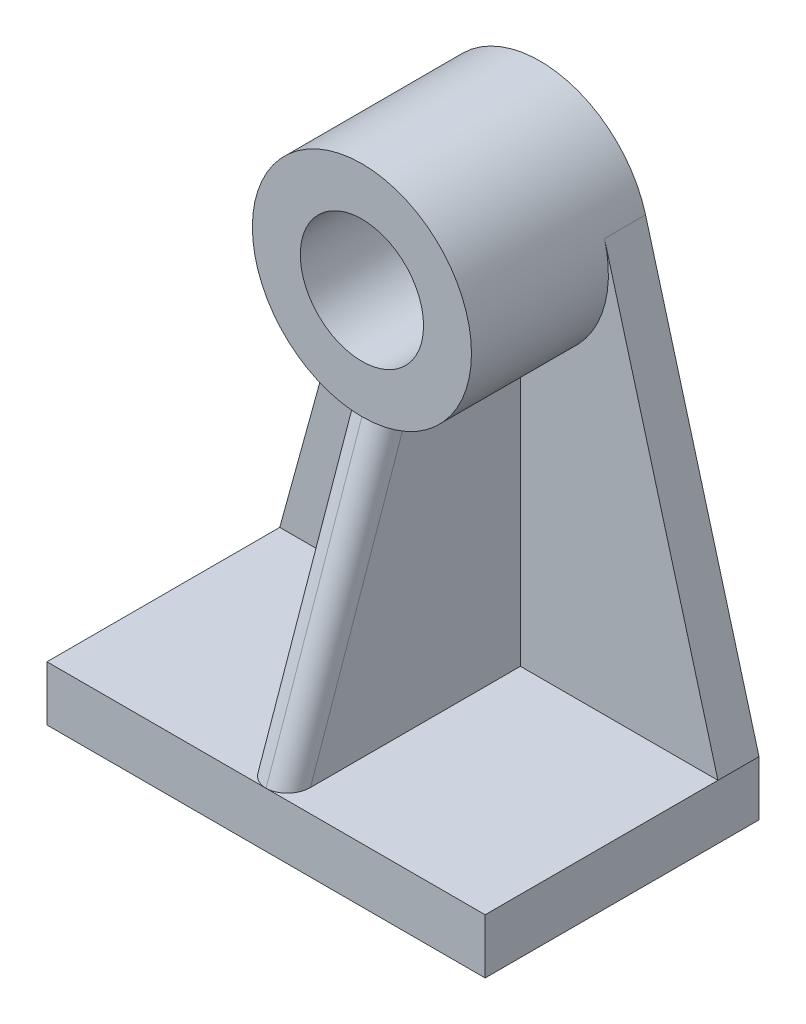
ISO-10303-21;
HEADER;
FILE_DESCRIPTION(('STEP AP214'),'2;1');
FILE_NAME('part.step','',(''),(''),'','','');
FILE_SCHEMA(('AUTOMOTIVE_DESIGN { 1 0 10303 214 1 1 1 1 }'));
ENDSEC;
DATA;
#1=APPLICATION_CONTEXT('core data for automotive mechanical design processes');
#2=APPLICATION_PROTOCOL_DEFINITION('international standard','automotive_design',2000,#1);
#3=PRODUCT_CONTEXT('',#1,'mechanical');
#4=PRODUCT('Part','Part','',(#3));
#5=PRODUCT_RELATED_PRODUCT_CATEGORY('part','',(#4));
#6=PRODUCT_DEFINITION_FORMATION('','',#4);
#7=PRODUCT_DEFINITION_CONTEXT('part definition',#1,'design');
#8=PRODUCT_DEFINITION('design','',#6,#7);
#9=PRODUCT_DEFINITION_SHAPE('','',#8);
#10=(LENGTH_UNIT() NAMED_UNIT(*) SI_UNIT(.MILLI.,.METRE.));
#11=(NAMED_UNIT(*) PLANE_ANGLE_UNIT() SI_UNIT($,.RADIAN.));
#12=(NAMED_UNIT(*) SI_UNIT($,.STERADIAN.) SOLID_ANGLE_UNIT());
#13=UNCERTAINTY_MEASURE_WITH_UNIT(LENGTH_MEASURE(1.E-05),#10,'distance_accuracy_value','');
#14=(GEOMETRIC_REPRESENTATION_CONTEXT(3) GLOBAL_UNCERTAINTY_ASSIGNED_CONTEXT((#13)) GLOBAL_UNIT_ASSIGNED_CONTEXT((#10,
#11,#12)) REPRESENTATION_CONTEXT('',''));
#15=CARTESIAN_POINT('',(0.,0.,0.));
#16=DIRECTION('',(0.,0.,1.));
#17=DIRECTION('',(1.,0.,0.));
#18=AXIS2_PLACEMENT_3D('',#15,#16,#17);
#19=CARTESIAN_POINT('',(0.,0.,9.525));
#20=DIRECTION('',(0.,0.,1.));
#21=DIRECTION('',(1.,0.,0.));
#22=AXIS2_PLACEMENT_3D('',#19,#20,#21);
#23=PLANE('',#22);
#24=DIRECTION('',(-1.,0.,0.));
#25=VECTOR('',#24,1.);
#26=CARTESIAN_POINT('',(-50.8,-88.9,9.525));
#27=LINE('',#26,#25);
#28=CARTESIAN_POINT('',(-5.,-88.9,9.525));
#29=VERTEX_POINT('',#28);
#30=CARTESIAN_POINT('',(-50.8,-88.9,9.525));
#31=VERTEX_POINT('',#30);
#32=EDGE_CURVE('E132',#29,#31,#27,.T.);
#33=ORIENTED_EDGE('',*,*,#32,.F.);
#34=DIRECTION('',(0.,1.,0.));
#35=VECTOR('',#34,1.);
#36=CARTESIAN_POINT('',(-5.,0.,9.525));
#37=LINE('',#36,#35);
#38=CARTESIAN_POINT('',(-5.,-24.9030118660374,9.525));
#39=VERTEX_POINT('',#38);
#40=EDGE_CURVE('E117',#29,#39,#37,.T.);
#41=ORIENTED_EDGE('',*,*,#40,.T.);
#42=CARTESIAN_POINT('',(0.,0.,9.525));
#43=DIRECTION('',(0.,0.,1.));
#44=DIRECTION('',(1.,0.,0.));
#45=AXIS2_PLACEMENT_3D('',#42,#43,#44);
#46=CIRCLE('',#45,25.4);
#47=CARTESIAN_POINT('',(-24.4901906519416,6.73725180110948,9.525));
#48=VERTEX_POINT('',#47);
#49=EDGE_CURVE('E202',#39,#48,#46,.F.);
#50=ORIENTED_EDGE('',*,*,#49,.T.);
#51=DIRECTION('',(-0.265246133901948,-0.964180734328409,0.));
#52=VECTOR('',#51,1.);
#53=CARTESIAN_POINT('',(-50.8,-88.9,9.525));
#54=LINE('',#53,#52);
#55=EDGE_CURVE('E141',#48,#31,#54,.T.);
#56=ORIENTED_EDGE('',*,*,#55,.T.);
#57=EDGE_LOOP('',(#33,#41,#50,#56));
#58=FACE_BOUND('',#57,.T.);
#59=ADVANCED_FACE('F28',(#58),#23,.T.);
#60=CARTESIAN_POINT('',(-50.8,-88.9,63.5));
#61=DIRECTION('',(0.,-1.,0.));
#62=DIRECTION('',(1.,0.,0.));
#63=AXIS2_PLACEMENT_3D('',#60,#61,#62);
#64=PLANE('',#63);
#65=DIRECTION('',(0.,0.,1.));
#66=VECTOR('',#65,1.);
#67=CARTESIAN_POINT('',(-5.,-88.9,63.5));
#68=LINE('',#67,#66);
#69=CARTESIAN_POINT('',(-5.,-88.9,58.2025949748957));
#70=VERTEX_POINT('',#69);
#71=EDGE_CURVE('E121',#29,#70,#68,.T.);
#72=ORIENTED_EDGE('',*,*,#71,.F.);
#73=ORIENTED_EDGE('',*,*,#32,.T.);
#74=DIRECTION('',(0.,0.,-1.));
#75=VECTOR('',#74,1.);
#76=CARTESIAN_POINT('',(-50.8,-88.9,63.5));
#77=LINE('',#76,#75);
#78=CARTESIAN_POINT('',(-50.8,-88.9,63.5));
#79=VERTEX_POINT('',#78);
#80=EDGE_CURVE('E162',#79,#31,#77,.T.);
#81=ORIENTED_EDGE('',*,*,#80,.F.);
#82=DIRECTION('',(-1.,0.,0.));
#83=VECTOR('',#82,1.);
#84=CARTESIAN_POINT('',(-50.8,-88.9,63.5));
#85=LINE('',#84,#83);
#86=CARTESIAN_POINT('',(0.,-88.9,63.5));
#87=VERTEX_POINT('',#86);
#88=EDGE_CURVE('E156',#87,#79,#85,.T.);
#89=ORIENTED_EDGE('',*,*,#88,.F.);
#90=CARTESIAN_POINT('',(0.,-88.9,58.2025949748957));
#91=DIRECTION('',(0.,-1.,0.));
#92=DIRECTION('',(0.,0.,-1.));
#93=AXIS2_PLACEMENT_3D('',#90,#91,#92);
#94=ELLIPSE('',#93,5.29740502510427,5.);
#95=EDGE_CURVE('E136',#87,#70,#94,.T.);
#96=ORIENTED_EDGE('',*,*,#95,.T.);
#97=EDGE_LOOP('',(#72,#73,#81,#89,#96));
#98=FACE_BOUND('',#97,.T.);
#99=ADVANCED_FACE('F130',(#98),#64,.F.);
#100=DIRECTION('',(0.,1.,0.));
#101=VECTOR('',#100,1.);
#102=CARTESIAN_POINT('',(5.,0.,9.525));
#103=LINE('',#102,#101);
#104=CARTESIAN_POINT('',(5.,-88.9,9.525));
#105=VERTEX_POINT('',#104);
#106=CARTESIAN_POINT('',(5.,-24.9030118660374,9.525));
#107=VERTEX_POINT('',#106);
#108=EDGE_CURVE('E371',#105,#107,#103,.T.);
#109=ORIENTED_EDGE('',*,*,#108,.F.);
#110=CARTESIAN_POINT('',(50.8,-88.9,9.525));
#111=VERTEX_POINT('',#110);
#112=EDGE_CURVE('E143',#111,#105,#27,.T.);
#113=ORIENTED_EDGE('',*,*,#112,.F.);
#114=DIRECTION('',(-0.265246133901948,0.964180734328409,0.));
#115=VECTOR('',#114,1.);
#116=CARTESIAN_POINT('',(50.8,-88.9,9.525));
#117=LINE('',#116,#115);
#118=CARTESIAN_POINT('',(24.4901906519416,6.73725180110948,9.525));
#119=VERTEX_POINT('',#118);
#120=EDGE_CURVE('E181',#111,#119,#117,.T.);
#121=ORIENTED_EDGE('',*,*,#120,.T.);
#122=EDGE_CURVE('E203',#119,#107,#46,.F.);
#123=ORIENTED_EDGE('',*,*,#122,.T.);
#124=EDGE_LOOP('',(#109,#113,#121,#123));
#125=FACE_BOUND('',#124,.T.);
#126=ADVANCED_FACE('F257',(#125),#23,.T.);
#127=CARTESIAN_POINT('',(-50.8,-88.9,9.525));
#128=DIRECTION('',(0.964180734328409,-0.265246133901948,0.));
#129=DIRECTION('',(0.265246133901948,0.964180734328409,0.));
#130=AXIS2_PLACEMENT_3D('',#127,#128,#129);
#131=PLANE('',#130);
#132=DIRECTION('',(-0.265246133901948,-0.964180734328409,0.));
#133=VECTOR('',#132,1.);
#134=CARTESIAN_POINT('',(-50.8,-88.9,0.));
#135=LINE('',#134,#133);
#136=CARTESIAN_POINT('',(-24.4901906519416,6.73725180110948,0.));
#137=VERTEX_POINT('',#136);
#138=CARTESIAN_POINT('',(-50.8,-88.9,0.));
#139=VERTEX_POINT('',#138);
#140=EDGE_CURVE('E167',#137,#139,#135,.T.);
#141=ORIENTED_EDGE('',*,*,#140,.T.);
#142=DIRECTION('',(0.,0.,-1.));
#143=VECTOR('',#142,1.);
#144=CARTESIAN_POINT('',(-50.8,-88.9,9.525));
#145=LINE('',#144,#143);
#146=EDGE_CURVE('E199',#31,#139,#145,.T.);
#147=ORIENTED_EDGE('',*,*,#146,.F.);
#148=ORIENTED_EDGE('',*,*,#55,.F.);
#149=DIRECTION('',(0.,0.,-1.));
#150=VECTOR('',#149,1.);
#151=CARTESIAN_POINT('',(-24.4901906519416,6.73725180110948,9.525));
#152=LINE('',#151,#150);
#153=EDGE_CURVE('E184',#48,#137,#152,.T.);
#154=ORIENTED_EDGE('',*,*,#153,.T.);
#155=EDGE_LOOP('',(#141,#147,#148,#154));
#156=FACE_BOUND('',#155,.T.);
#157=ADVANCED_FACE('F30',(#156),#131,.F.);
#158=CARTESIAN_POINT('',(-50.8,-101.6,9.525));
#159=DIRECTION('',(1.,0.,0.));
#160=DIRECTION('',(0.,1.,0.));
#161=AXIS2_PLACEMENT_3D('',#158,#159,#160);
#162=PLANE('',#161);
#163=DIRECTION('',(0.,-1.,0.));
#164=VECTOR('',#163,1.);
#165=CARTESIAN_POINT('',(-50.8,-101.6,0.));
#166=LINE('',#165,#164);
#167=CARTESIAN_POINT('',(-50.8,-101.6,0.));
#168=VERTEX_POINT('',#167);
#169=EDGE_CURVE('E170',#139,#168,#166,.T.);
#170=ORIENTED_EDGE('',*,*,#169,.T.);
#171=DIRECTION('',(0.,0.,-1.));
#172=VECTOR('',#171,1.);
#173=CARTESIAN_POINT('',(-50.8,-101.6,9.525));
#174=LINE('',#173,#172);
#175=CARTESIAN_POINT('',(-50.8,-101.6,63.5));
#176=VERTEX_POINT('',#175);
#177=EDGE_CURVE('E196',#176,#168,#174,.T.);
#178=ORIENTED_EDGE('',*,*,#177,.F.);
#179=DIRECTION('',(0.,-1.,0.));
#180=VECTOR('',#179,1.);
#181=CARTESIAN_POINT('',(-50.8,-88.9,63.5));
#182=LINE('',#181,#180);
#183=EDGE_CURVE('E159',#79,#176,#182,.T.);
#184=ORIENTED_EDGE('',*,*,#183,.F.);
#185=ORIENTED_EDGE('',*,*,#80,.T.);
#186=ORIENTED_EDGE('',*,*,#146,.T.);
#187=EDGE_LOOP('',(#170,#178,#184,#185,#186));
#188=FACE_BOUND('',#187,.T.);
#189=ADVANCED_FACE('F265',(#188),#162,.F.);
#190=CARTESIAN_POINT('',(-50.8,-101.6,9.525));
#191=DIRECTION('',(0.,1.,0.));
#192=DIRECTION('',(-1.,0.,0.));
#193=AXIS2_PLACEMENT_3D('',#190,#191,#192);
#194=PLANE('',#193);
#195=DIRECTION('',(0.,0.,-1.));
#196=VECTOR('',#195,1.);
#197=CARTESIAN_POINT('',(50.8,-101.6,9.525));
#198=LINE('',#197,#196);
#199=CARTESIAN_POINT('',(50.8,-101.6,63.5));
#200=VERTEX_POINT('',#199);
#201=CARTESIAN_POINT('',(50.8,-101.6,0.));
#202=VERTEX_POINT('',#201);
#203=EDGE_CURVE('E193',#200,#202,#198,.T.);
#204=ORIENTED_EDGE('',*,*,#203,.F.);
#205=DIRECTION('',(1.,0.,0.));
#206=VECTOR('',#205,1.);
#207=CARTESIAN_POINT('',(-50.8,-101.6,63.5));
#208=LINE('',#207,#206);
#209=EDGE_CURVE('E147',#176,#200,#208,.T.);
#210=ORIENTED_EDGE('',*,*,#209,.F.);
#211=ORIENTED_EDGE('',*,*,#177,.T.);
#212=DIRECTION('',(1.,0.,0.));
#213=VECTOR('',#212,1.);
#214=CARTESIAN_POINT('',(-50.8,-101.6,0.));
#215=LINE('',#214,#213);
#216=EDGE_CURVE('E172',#168,#202,#215,.T.);
#217=ORIENTED_EDGE('',*,*,#216,.T.);
#218=EDGE_LOOP('',(#204,#210,#211,#217));
#219=FACE_BOUND('',#218,.T.);
#220=ADVANCED_FACE('F294',(#219),#194,.F.);
#221=CARTESIAN_POINT('',(50.8,-101.6,9.525));
#222=DIRECTION('',(-1.,0.,0.));
#223=DIRECTION('',(0.,0.,1.));
#224=AXIS2_PLACEMENT_3D('',#221,#222,#223);
#225=PLANE('',#224);
#226=DIRECTION('',(0.,1.,0.));
#227=VECTOR('',#226,1.);
#228=CARTESIAN_POINT('',(50.8,-101.6,0.));
#229=LINE('',#228,#227);
#230=CARTESIAN_POINT('',(50.8,-88.9,0.));
#231=VERTEX_POINT('',#230);
#232=EDGE_CURVE('E174',#202,#231,#229,.T.);
#233=ORIENTED_EDGE('',*,*,#232,.T.);
#234=DIRECTION('',(0.,0.,-1.));
#235=VECTOR('',#234,1.);
#236=CARTESIAN_POINT('',(50.8,-88.9,9.525));
#237=LINE('',#236,#235);
#238=EDGE_CURVE('E190',#111,#231,#237,.T.);
#239=ORIENTED_EDGE('',*,*,#238,.F.);
#240=DIRECTION('',(0.,0.,-1.));
#241=VECTOR('',#240,1.);
#242=CARTESIAN_POINT('',(50.8,-88.9,63.5));
#243=LINE('',#242,#241);
#244=CARTESIAN_POINT('',(50.8,-88.9,63.5));
#245=VERTEX_POINT('',#244);
#246=EDGE_CURVE('E164',#245,#111,#243,.T.);
#247=ORIENTED_EDGE('',*,*,#246,.F.);
#248=DIRECTION('',(0.,1.,0.));
#249=VECTOR('',#248,1.);
#250=CARTESIAN_POINT('',(50.8,-101.6,63.5));
#251=LINE('',#250,#249);
#252=EDGE_CURVE('E154',#200,#245,#251,.T.);
#253=ORIENTED_EDGE('',*,*,#252,.F.);
#254=ORIENTED_EDGE('',*,*,#203,.T.);
#255=EDGE_LOOP('',(#233,#239,#247,#253,#254));
#256=FACE_BOUND('',#255,.T.);
#257=ADVANCED_FACE('F279',(#256),#225,.F.);
#258=CARTESIAN_POINT('',(50.8,-88.9,9.525));
#259=DIRECTION('',(-0.964180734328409,-0.265246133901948,0.));
#260=DIRECTION('',(0.265246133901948,-0.964180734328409,0.));
#261=AXIS2_PLACEMENT_3D('',#258,#259,#260);
#262=PLANE('',#261);
#263=DIRECTION('',(-0.265246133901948,0.964180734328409,0.));
#264=VECTOR('',#263,1.);
#265=CARTESIAN_POINT('',(50.8,-88.9,0.));
#266=LINE('',#265,#264);
#267=CARTESIAN_POINT('',(24.4901906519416,6.73725180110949,0.));
#268=VERTEX_POINT('',#267);
#269=EDGE_CURVE('E176',#231,#268,#266,.T.);
#270=ORIENTED_EDGE('',*,*,#269,.T.);
#271=DIRECTION('',(0.,0.,-1.));
#272=VECTOR('',#271,1.);
#273=CARTESIAN_POINT('',(24.4901906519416,6.73725180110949,9.525));
#274=LINE('',#273,#272);
#275=EDGE_CURVE('E187',#119,#268,#274,.T.);
#276=ORIENTED_EDGE('',*,*,#275,.F.);
#277=ORIENTED_EDGE('',*,*,#120,.F.);
#278=ORIENTED_EDGE('',*,*,#238,.T.);
#279=EDGE_LOOP('',(#270,#276,#277,#278));
#280=FACE_BOUND('',#279,.T.);
#281=ADVANCED_FACE('F276',(#280),#262,.F.);
#282=CARTESIAN_POINT('',(0.,0.,9.525));
#283=DIRECTION('',(0.,0.,-1.));
#284=DIRECTION('',(-1.,0.,0.));
#285=AXIS2_PLACEMENT_3D('',#282,#283,#284);
#286=CYLINDRICAL_SURFACE('',#285,25.4);
#287=CARTESIAN_POINT('',(0.,0.,41.275));
#288=DIRECTION('',(0.,0.,1.));
#289=DIRECTION('',(1.,0.,0.));
#290=AXIS2_PLACEMENT_3D('',#287,#288,#289);
#291=CIRCLE('',#290,25.4);
#292=CARTESIAN_POINT('',(0.,-25.4,41.275));
#293=VERTEX_POINT('',#292);
#294=EDGE_CURVE('E144',#293,#293,#291,.T.);
#295=ORIENTED_EDGE('',*,*,#294,.F.);
#296=CARTESIAN_POINT('',(0.,-25.4,41.275));
#297=CARTESIAN_POINT('',(0.128951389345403,-25.4000104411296,41.2750281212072));
#298=CARTESIAN_POINT('',(0.257891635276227,-25.3990183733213,41.2693722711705));
#299=CARTESIAN_POINT('',(0.514718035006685,-25.3951060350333,41.2469023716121));
#300=CARTESIAN_POINT('',(0.64260457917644,-25.3921865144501,41.2300926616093));
#301=CARTESIAN_POINT('',(0.895812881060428,-25.3845135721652,41.1856264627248));
#302=CARTESIAN_POINT('',(1.02114369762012,-25.379768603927,41.1580199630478));
#303=CARTESIAN_POINT('',(1.2689537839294,-25.3685855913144,41.0923377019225));
#304=CARTESIAN_POINT('',(1.39143288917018,-25.3621474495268,41.0542613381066));
#305=CARTESIAN_POINT('',(1.63256116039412,-25.3477673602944,40.9681736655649));
#306=CARTESIAN_POINT('',(1.75121548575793,-25.3398275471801,40.9201764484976));
#307=CARTESIAN_POINT('',(1.98418920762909,-25.3226511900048,40.8147739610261));
#308=CARTESIAN_POINT('',(2.0985069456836,-25.3134141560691,40.7573651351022));
#309=CARTESIAN_POINT('',(2.43411070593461,-25.2840943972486,40.5718465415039));
#310=CARTESIAN_POINT('',(2.64805820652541,-25.2624023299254,40.4304406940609));
#311=CARTESIAN_POINT('',(3.06411803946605,-25.2154265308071,40.1082096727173));
#312=CARTESIAN_POINT('',(3.26477406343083,-25.1900060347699,39.9255428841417));
#313=CARTESIAN_POINT('',(3.63645087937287,-25.1390421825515,39.532199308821));
#314=CARTESIAN_POINT('',(3.80745832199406,-25.1134987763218,39.3215099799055));
#315=CARTESIAN_POINT('',(4.13573601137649,-25.0616546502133,38.8514118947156));
#316=CARTESIAN_POINT('',(4.28902259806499,-25.0356184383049,38.589187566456));
#317=CARTESIAN_POINT('',(4.55289752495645,-24.9889799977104,38.0436979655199));
#318=CARTESIAN_POINT('',(4.66348605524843,-24.9683777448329,37.7604327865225));
#319=CARTESIAN_POINT('',(4.83310914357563,-24.9360781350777,37.2005721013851));
#320=CARTESIAN_POINT('',(4.89528226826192,-24.923846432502,36.92496479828));
#321=CARTESIAN_POINT('',(4.95786561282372,-24.9114425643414,36.5069692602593));
#322=CARTESIAN_POINT('',(4.97361413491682,-24.9082984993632,36.3668254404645));
#323=CARTESIAN_POINT('',(4.99468129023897,-24.9040803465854,36.0856914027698));
#324=CARTESIAN_POINT('',(4.99999729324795,-24.903006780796,35.9447009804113));
#325=CARTESIAN_POINT('',(5.,-24.9030118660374,35.8036491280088));
#326=B_SPLINE_CURVE_WITH_KNOTS('',3,(#296,#297,#298,#299,#300,#301,#302,#303,#304,#305,#306,
#307,#308,#309,#310,#311,#312,#313,#314,#315,#316,#317,#318,#319,#320,#321,#322,#323,#324,#325),
.UNSPECIFIED.,.F.,.F.,(4,2,2,2,2,2,2,2,2,2,2,2,2,2,4),(0.,0.386708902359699,0.773267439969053,
1.15805700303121,1.54286870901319,1.92713753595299,2.31155186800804,3.0803459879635,
3.89477377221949,4.70956730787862,5.62022848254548,6.53088560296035,7.37597613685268,
7.79880574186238,8.22174193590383),.UNSPECIFIED.);
#327=CARTESIAN_POINT('',(5.,-24.9030118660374,35.8036491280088));
#328=VERTEX_POINT('',#327);
#329=EDGE_CURVE('E36',#293,#328,#326,.T.);
#330=ORIENTED_EDGE('',*,*,#329,.T.);
#331=DIRECTION('',(0.,0.,-1.));
#332=VECTOR('',#331,1.);
#333=CARTESIAN_POINT('',(5.,-24.9030118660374,9.525));
#334=LINE('',#333,#332);
#335=EDGE_CURVE('E374',#328,#107,#334,.T.);
#336=ORIENTED_EDGE('',*,*,#335,.T.);
#337=ORIENTED_EDGE('',*,*,#122,.F.);
#338=ORIENTED_EDGE('',*,*,#275,.T.);
#339=CARTESIAN_POINT('',(0.,0.,0.));
#340=DIRECTION('',(0.,0.,1.));
#341=DIRECTION('',(1.,0.,0.));
#342=AXIS2_PLACEMENT_3D('',#339,#340,#341);
#343=CIRCLE('',#342,25.4);
#344=EDGE_CURVE('E178',#268,#137,#343,.T.);
#345=ORIENTED_EDGE('',*,*,#344,.T.);
#346=ORIENTED_EDGE('',*,*,#153,.F.);
#347=ORIENTED_EDGE('',*,*,#49,.F.);
#348=DIRECTION('',(0.,0.,-1.));
#349=VECTOR('',#348,1.);
#350=CARTESIAN_POINT('',(-5.,-24.9030118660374,9.525));
#351=LINE('',#350,#349);
#352=CARTESIAN_POINT('',(-5.,-24.9030118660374,35.8036491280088));
#353=VERTEX_POINT('',#352);
#354=EDGE_CURVE('E124',#353,#39,#351,.T.);
#355=ORIENTED_EDGE('',*,*,#354,.F.);
#356=CARTESIAN_POINT('',(-5.,-24.9030118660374,35.8036491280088));
#357=CARTESIAN_POINT('',(-5.00000741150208,-24.9029986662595,35.9640420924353));
#358=CARTESIAN_POINT('',(-4.99312465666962,-24.904392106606,36.1244071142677));
#359=CARTESIAN_POINT('',(-4.96589925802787,-24.9098412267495,36.4439024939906));
#360=CARTESIAN_POINT('',(-4.94556043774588,-24.9138961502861,36.6030331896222));
#361=CARTESIAN_POINT('',(-4.89176455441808,-24.9245131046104,36.9188469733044));
#362=CARTESIAN_POINT('',(-4.85831801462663,-24.9310731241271,37.0755319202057));
#363=CARTESIAN_POINT('',(-4.77867994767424,-24.9464595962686,37.3854838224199));
#364=CARTESIAN_POINT('',(-4.73248756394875,-24.9552862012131,37.538750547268));
#365=CARTESIAN_POINT('',(-4.57540148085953,-24.9847400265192,37.9916418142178));
#366=CARTESIAN_POINT('',(-4.44591458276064,-25.0083590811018,38.2848460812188));
#367=CARTESIAN_POINT('',(-4.14028795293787,-25.0607643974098,38.8455658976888));
#368=CARTESIAN_POINT('',(-3.96413078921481,-25.0895525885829,39.1130717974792));
#369=CARTESIAN_POINT('',(-3.66669538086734,-25.1341502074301,39.4896539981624));
#370=CARTESIAN_POINT('',(-3.56136565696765,-25.1493367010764,39.6116512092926));
#371=CARTESIAN_POINT('',(-3.34021503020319,-25.1796627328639,39.8457144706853));
#372=CARTESIAN_POINT('',(-3.22439861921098,-25.1948022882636,39.9577847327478));
#373=CARTESIAN_POINT('',(-2.98286610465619,-25.2245378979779,40.1707935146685));
#374=CARTESIAN_POINT('',(-2.85714953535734,-25.2391339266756,40.2717315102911));
#375=CARTESIAN_POINT('',(-2.59657879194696,-25.2672700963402,40.4612015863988));
#376=CARTESIAN_POINT('',(-2.46172595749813,-25.2808103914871,40.5497354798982));
#377=CARTESIAN_POINT('',(-2.19501975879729,-25.3053027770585,40.7065447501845));
#378=CARTESIAN_POINT('',(-2.0637988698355,-25.3163754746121,40.7758772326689));
#379=CARTESIAN_POINT('',(-1.79534875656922,-25.3368275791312,40.9020109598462));
#380=CARTESIAN_POINT('',(-1.65812062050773,-25.3462072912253,40.9588144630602));
#381=CARTESIAN_POINT('',(-1.379017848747,-25.3629219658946,41.0589168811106));
#382=CARTESIAN_POINT('',(-1.23715343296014,-25.3702611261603,41.1022435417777));
#383=CARTESIAN_POINT('',(-0.949836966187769,-25.3826409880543,41.1747968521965));
#384=CARTESIAN_POINT('',(-0.804387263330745,-25.387683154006,41.2040324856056));
#385=CARTESIAN_POINT('',(-0.548956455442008,-25.3943006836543,41.2422665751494));
#386=CARTESIAN_POINT('',(-0.439468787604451,-25.3964340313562,41.2545352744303));
#387=CARTESIAN_POINT('',(-0.219993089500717,-25.3992853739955,41.2709035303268));
#388=CARTESIAN_POINT('',(-0.110005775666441,-25.4000049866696,41.2750124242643));
#389=CARTESIAN_POINT('',(0.,-25.4,41.275));
#390=B_SPLINE_CURVE_WITH_KNOTS('',3,(#356,#357,#358,#359,#360,#361,#362,#363,#364,#365,#366,
#367,#368,#369,#370,#371,#372,#373,#374,#375,#376,#377,#378,#379,#380,#381,#382,#383,#384,#385,
#386,#387,#388,#389),.UNSPECIFIED.,.F.,.F.,(4,2,2,2,2,2,2,2,2,2,2,2,2,2,2,2,4),(0.,
0.480982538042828,0.961828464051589,1.4422891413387,1.92278211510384,2.88229796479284,
3.84217271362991,4.32730583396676,4.81223212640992,5.29718124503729,5.78205940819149,
6.2279035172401,6.67366719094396,7.11850696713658,7.56306276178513,7.89334442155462,
8.22324791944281),.UNSPECIFIED.);
#391=EDGE_CURVE('E209',#353,#293,#390,.T.);
#392=ORIENTED_EDGE('',*,*,#391,.T.);
#393=EDGE_LOOP('',(#295,#330,#336,#337,#338,#345,#346,#347,#355,#392));
#394=FACE_BOUND('',#393,.T.);
#395=ADVANCED_FACE('F216',(#394),#286,.T.);
#396=CARTESIAN_POINT('',(0.,0.,0.));
#397=DIRECTION('',(0.,0.,1.));
#398=DIRECTION('',(1.,0.,0.));
#399=AXIS2_PLACEMENT_3D('',#396,#397,#398);
#400=PLANE('',#399);
#401=CARTESIAN_POINT('',(0.,0.,0.));
#402=DIRECTION('',(0.,0.,1.));
#403=DIRECTION('',(1.,0.,0.));
#404=AXIS2_PLACEMENT_3D('',#401,#402,#403);
#405=CIRCLE('',#404,14.2875);
#406=CARTESIAN_POINT('',(14.2875,0.,0.));
#407=VERTEX_POINT('',#406);
#408=EDGE_CURVE('E149',#407,#407,#405,.T.);
#409=ORIENTED_EDGE('',*,*,#408,.T.);
#410=EDGE_LOOP('',(#409));
#411=FACE_BOUND('',#410,.T.);
#412=ORIENTED_EDGE('',*,*,#232,.F.);
#413=ORIENTED_EDGE('',*,*,#216,.F.);
#414=ORIENTED_EDGE('',*,*,#169,.F.);
#415=ORIENTED_EDGE('',*,*,#140,.F.);
#416=ORIENTED_EDGE('',*,*,#344,.F.);
#417=ORIENTED_EDGE('',*,*,#269,.F.);
#418=EDGE_LOOP('',(#412,#413,#414,#415,#416,#417));
#419=FACE_BOUND('',#418,.T.);
#420=ADVANCED_FACE('F253',(#411,#419),#400,.F.);
#421=ORIENTED_EDGE('',*,*,#112,.T.);
#422=DIRECTION('',(0.,0.,1.));
#423=VECTOR('',#422,1.);
#424=CARTESIAN_POINT('',(5.,-88.9,63.5));
#425=LINE('',#424,#423);
#426=CARTESIAN_POINT('',(5.,-88.9,58.2025949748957));
#427=VERTEX_POINT('',#426);
#428=EDGE_CURVE('E369',#105,#427,#425,.T.);
#429=ORIENTED_EDGE('',*,*,#428,.T.);
#430=CARTESIAN_POINT('',(0.,-88.9,58.2025949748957));
#431=DIRECTION('',(0.,-1.,0.));
#432=DIRECTION('',(0.,0.,1.));
#433=AXIS2_PLACEMENT_3D('',#430,#431,#432);
#434=ELLIPSE('',#433,5.29740502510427,5.);
#435=EDGE_CURVE('E11',#427,#87,#434,.T.);
#436=ORIENTED_EDGE('',*,*,#435,.T.);
#437=EDGE_CURVE('E157',#245,#87,#85,.T.);
#438=ORIENTED_EDGE('',*,*,#437,.F.);
#439=ORIENTED_EDGE('',*,*,#246,.T.);
#440=EDGE_LOOP('',(#421,#429,#436,#438,#439));
#441=FACE_BOUND('',#440,.T.);
#442=ADVANCED_FACE('F249',(#441),#64,.F.);
#443=CARTESIAN_POINT('',(50.8,-101.6,63.5));
#444=DIRECTION('',(0.,0.,1.));
#445=DIRECTION('',(1.,0.,0.));
#446=AXIS2_PLACEMENT_3D('',#443,#444,#445);
#447=PLANE('',#446);
#448=ORIENTED_EDGE('',*,*,#437,.T.);
#449=ORIENTED_EDGE('',*,*,#88,.T.);
#450=ORIENTED_EDGE('',*,*,#183,.T.);
#451=ORIENTED_EDGE('',*,*,#209,.T.);
#452=ORIENTED_EDGE('',*,*,#252,.T.);
#453=EDGE_LOOP('',(#448,#449,#450,#451,#452));
#454=FACE_BOUND('',#453,.T.);
#455=ADVANCED_FACE('F245',(#454),#447,.T.);
#456=CARTESIAN_POINT('',(0.,0.,41.275));
#457=DIRECTION('',(0.,0.,1.));
#458=DIRECTION('',(1.,0.,0.));
#459=AXIS2_PLACEMENT_3D('',#456,#457,#458);
#460=PLANE('',#459);
#461=CARTESIAN_POINT('',(0.,0.,41.275));
#462=DIRECTION('',(0.,0.,1.));
#463=DIRECTION('',(1.,0.,0.));
#464=AXIS2_PLACEMENT_3D('',#461,#462,#463);
#465=CIRCLE('',#464,14.2875);
#466=CARTESIAN_POINT('',(14.2875,0.,41.275));
#467=VERTEX_POINT('',#466);
#468=EDGE_CURVE('E376',#467,#467,#465,.T.);
#469=ORIENTED_EDGE('',*,*,#468,.F.);
#470=EDGE_LOOP('',(#469));
#471=FACE_BOUND('',#470,.T.);
#472=ORIENTED_EDGE('',*,*,#294,.T.);
#473=EDGE_LOOP('',(#472));
#474=FACE_BOUND('',#473,.T.);
#475=ADVANCED_FACE('F241',(#471,#474),#460,.T.);
#476=CARTESIAN_POINT('',(0.,0.,0.));
#477=DIRECTION('',(0.,0.,1.));
#478=DIRECTION('',(1.,0.,0.));
#479=AXIS2_PLACEMENT_3D('',#476,#477,#478);
#480=CYLINDRICAL_SURFACE('',#479,14.2875);
#481=ORIENTED_EDGE('',*,*,#408,.F.);
#482=EDGE_LOOP('',(#481));
#483=FACE_BOUND('',#482,.T.);
#484=ORIENTED_EDGE('',*,*,#468,.T.);
#485=EDGE_LOOP('',(#484));
#486=FACE_BOUND('',#485,.T.);
#487=ADVANCED_FACE('F238',(#483,#486),#480,.F.);
#488=CARTESIAN_POINT('',(5.,-38.1,31.75));
#489=DIRECTION('',(1.,0.,0.));
#490=DIRECTION('',(0.,0.,-1.));
#491=AXIS2_PLACEMENT_3D('',#488,#489,#490);
#492=PLANE('',#491);
#493=ORIENTED_EDGE('',*,*,#335,.F.);
#494=DIRECTION('',(0.,-0.943858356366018,0.330350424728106));
#495=VECTOR('',#494,1.);
#496=CARTESIAN_POINT('',(5.,-35.3958501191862,39.4761425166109));
#497=LINE('',#496,#495);
#498=EDGE_CURVE('E43',#328,#427,#497,.T.);
#499=ORIENTED_EDGE('',*,*,#498,.T.);
#500=ORIENTED_EDGE('',*,*,#428,.F.);
#501=ORIENTED_EDGE('',*,*,#108,.T.);
#502=EDGE_LOOP('',(#493,#499,#500,#501));
#503=FACE_BOUND('',#502,.T.);
#504=ADVANCED_FACE('F235',(#503),#492,.T.);
#505=CARTESIAN_POINT('',(-5.,-38.1,31.75));
#506=DIRECTION('',(1.,0.,0.));
#507=DIRECTION('',(0.,0.,-1.));
#508=AXIS2_PLACEMENT_3D('',#505,#506,#507);
#509=PLANE('',#508);
#510=ORIENTED_EDGE('',*,*,#71,.T.);
#511=DIRECTION('',(0.,-0.943858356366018,0.330350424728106));
#512=VECTOR('',#511,1.);
#513=CARTESIAN_POINT('',(-5.,-26.5547639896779,36.381762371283));
#514=LINE('',#513,#512);
#515=EDGE_CURVE('E206',#70,#353,#514,.F.);
#516=ORIENTED_EDGE('',*,*,#515,.T.);
#517=ORIENTED_EDGE('',*,*,#354,.T.);
#518=ORIENTED_EDGE('',*,*,#40,.F.);
#519=EDGE_LOOP('',(#510,#516,#517,#518));
#520=FACE_BOUND('',#519,.T.);
#521=ADVANCED_FACE('F119',(#520),#509,.F.);
#522=CARTESIAN_POINT('',(0.,-90.5517521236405,58.7807082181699));
#523=DIRECTION('',(0.,-0.943858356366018,0.330350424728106));
#524=DIRECTION('',(0.,-0.330350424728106,-0.943858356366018));
#525=AXIS2_PLACEMENT_3D('',#522,#523,#524);
#526=CYLINDRICAL_SURFACE('',#525,5.);
#527=DIRECTION('',(0.,0.943858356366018,-0.330350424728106));
#528=VECTOR('',#527,1.);
#529=CARTESIAN_POINT('',(0.,-88.9,63.5));
#530=LINE('',#529,#528);
#531=EDGE_CURVE('E137',#87,#293,#530,.T.);
#532=ORIENTED_EDGE('',*,*,#531,.F.);
#533=ORIENTED_EDGE('',*,*,#435,.F.);
#534=ORIENTED_EDGE('',*,*,#498,.F.);
#535=ORIENTED_EDGE('',*,*,#329,.F.);
#536=EDGE_LOOP('',(#532,#533,#534,#535));
#537=FACE_BOUND('',#536,.T.);
#538=ADVANCED_FACE('F224',(#537),#526,.T.);
#539=CARTESIAN_POINT('',(0.,-35.3958501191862,39.4761425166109));
#540=DIRECTION('',(0.,0.943858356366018,-0.330350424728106));
#541=DIRECTION('',(0.,0.330350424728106,0.943858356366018));
#542=AXIS2_PLACEMENT_3D('',#539,#540,#541);
#543=CYLINDRICAL_SURFACE('',#542,5.);
#544=ORIENTED_EDGE('',*,*,#95,.F.);
#545=ORIENTED_EDGE('',*,*,#531,.T.);
#546=ORIENTED_EDGE('',*,*,#391,.F.);
#547=ORIENTED_EDGE('',*,*,#515,.F.);
#548=EDGE_LOOP('',(#544,#545,#546,#547));
#549=FACE_BOUND('',#548,.T.);
#550=ADVANCED_FACE('F220',(#549),#543,.T.);
#551=CLOSED_SHELL('',(#59,#99,#126,#157,#189,#220,#257,#281,#395,#420,#442,#455,#475,#487,#504,
#521,#538,#550));
#552=MANIFOLD_SOLID_BREP('B2',#551);
#553=ADVANCED_BREP_SHAPE_REPRESENTATION('',(#18,#552),#14);
#554=SHAPE_DEFINITION_REPRESENTATION(#9,#553);
ENDSEC;
END-ISO-10303-21;
